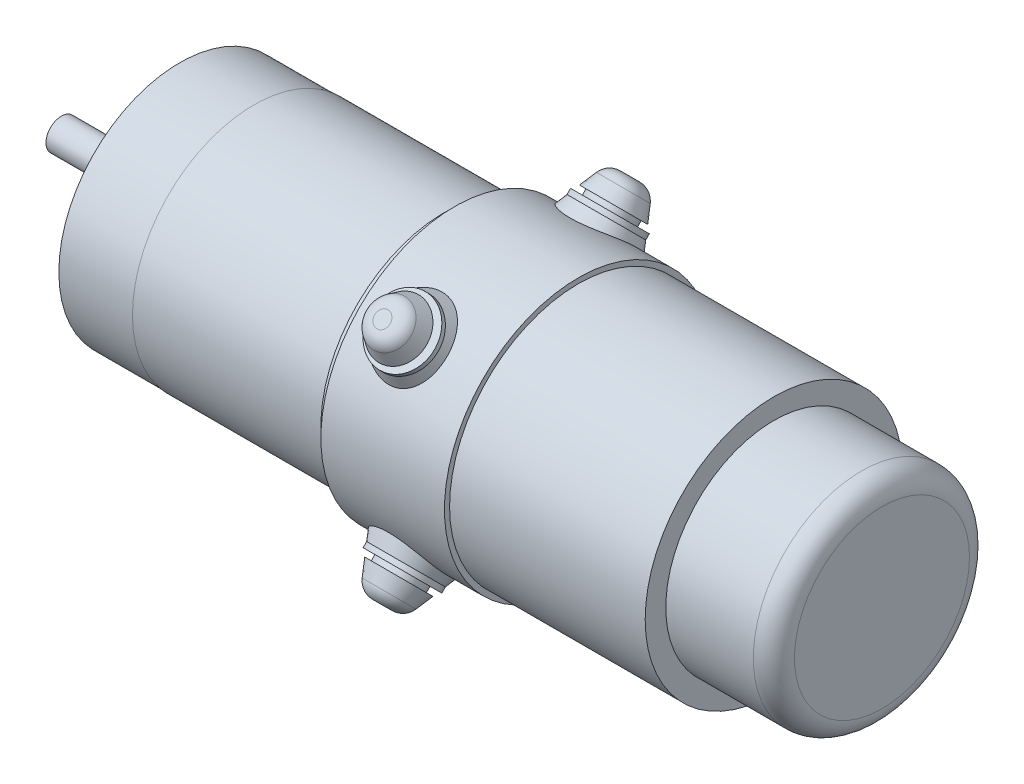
from build123d import *

# Parameters (mm, degrees)
BOSS_EXTRU_2_REACH                 = 176.404
BOSS_EXTRU_2_END_RADIUS            = 26
ESQUISSE3_R                        = 3.5
BOSS_EXTRU_2_DRAFT                 = 23
CONG_1_R                           = 3
BOSS_EXTRU_3_REACH                 = 174.245
ESQUISSE4_R                        = 6.25
ESQUISSE5_R                        = 5.834611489
ESQUISSE5_R_2                      = 4.38
ENL_V_MAT_EXTRU_1_DEPTH            = 1
R_P_TITION_CIRCULAIRE1_COUNT       = 4
CONG_1_OF_R_P_TITION_CIRCULAIRE1_R = 3
R_P_TITION_CIRCULAIRE2_COUNT       = 4


with BuildPart() as part:
    # Esquisse1 → Base-R_volution (revolve)
    with BuildSketch(Plane.XY, mode=Mode.PRIVATE) as base_r_volution_sk:
        with BuildLine():
            Line((0, 0), (0, 17))
            ThreePointArc((0, 17), (-1.171572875, 19.828427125), (-4, 21))
            Line((-4, 21), (-21, 21))
            Line((-21, 21), (-21, 25))
            Line((-21, 25), (-59, 25))
            Line((-59, 25), (-59, 26))
            Line((-59, 26), (-83, 26))
            Line((-83, 26), (-83, 24))
            Line((-83, 24), (-85, 24))
            Line((-85, 24), (-85, 23.6))
            Line((-85, 23.6), (-122, 23.6))
            Line((-122, 23.6), (-122, 23.5))
            Line((-122, 23.5), (-136.4, 23.5))
            Line((-136.4, 23.5), (-136.4, 12.5))
            Line((-136.4, 12.5), (-139.4, 12.5))
            Line((-139.4, 12.5), (-139.4, 3))
            Line((-139.4, 3), (-159.4, 3))
            Line((-159.4, 3), (-159.4, 0))
            Line((-159.4, 0), (-134.247535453, 0))
            Line((-134.247535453, 0), (-134.247535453, 21))
            Line((-134.247535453, 21), (-24.682142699, 21))
            Line((-24.682142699, 21), (-24.682142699, 17))
            Line((-24.682142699, 17), (-4.229936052, 17))
            Line((-4.229936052, 17), (-4.229936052, 0))
            Line((-4.229936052, 0), (0, 0))
        make_face()
    revolve(base_r_volution_sk.sketch.rotate(Axis((0, 0, 0), (-1, 0, 0)), 90), axis=Axis((0, 0, 0), (-1, 0, 0)))

    # Boss.-Extru.2: up to this cylinder (the profile starts outside it)
    boss_extru_2_end = Plane(origin=(-73, 0, 0), z_dir=(1, 0, 0)) * Cylinder(BOSS_EXTRU_2_END_RADIUS, 405.808, mode=Mode.PRIVATE)



with BuildPart() as boss_extru_2_long_prism_1:
    # Esquisse3 → Boss.-Extru.2 (the long prism of profile 1, to be tilted and cut off)
    with BuildSketch(Plane(origin=(0, 24.04163056, 24.04163056), x_dir=(-1, 0, 0), z_dir=(0, 0.7071067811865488, 0.7071067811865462))):
        with Locations((73, 0)):
            Circle(ESQUISSE3_R)
    extrude(amount=-BOSS_EXTRU_2_REACH)
    boss_extru_2_tool1_sides = [boss_extru_2_long_prism_1.faces().sort_by_distance(p)[0] for p in [
        (-69.5, -38.326601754, -38.326601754),
    ]]
    draft(boss_extru_2_tool1_sides, Plane(origin=(0, 24.04163056, 24.04163056), x_dir=(-1, 0, 0), z_dir=(0, 0.7071067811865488, 0.7071067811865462)), BOSS_EXTRU_2_DRAFT)  # the draft: side faces tilted about the start plane


with BuildPart() as part_1:
    add(part.part)
    boss_extru_2_tool1 = boss_extru_2_long_prism_1.part - boss_extru_2_end
    boss_extru_2 = boss_extru_2_tool1.solids().sort_by_distance((-73, 24.041631, 24.041631))[0]
    add(boss_extru_2)

    # Cong_1
    cong_1_edges = [part_1.edges().sort_by_distance(p)[0] for p in [
        (-69.5, 24.04163056, 24.04163056),
    ]]
    fillet(cong_1_edges, radius=CONG_1_R)

    # Esquisse4 → Boss.-Extru.3 (add, up to next)
    with BuildSketch(Plane(origin=(0, 20.152543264, 20.152543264), x_dir=(-1, 0, 0), z_dir=(0, 0.7071067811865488, 0.7071067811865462)), mode=Mode.PRIVATE) as boss_extru_3_sk1:
        with Locations(Location((73, 0, 0), (0, 0, 90))):
            Circle(ESQUISSE4_R)
    boss_extru_3_tool1 = extrude(boss_extru_3_sk1.sketch, amount=-BOSS_EXTRU_3_REACH, mode=Mode.PRIVATE) - part_1.part
    boss_extru_3 = boss_extru_3_tool1.solids().sort_by_distance((-73, 20.152543, 20.152543))[0]
    add(boss_extru_3)

    # Esquisse5 → Enl_v. mat.-Extru.1 (cut)
    with BuildSketch(Plane(origin=(0, 20.152543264, 20.152543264), x_dir=(-1, 0, 0), z_dir=(0, 0.7071067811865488, 0.7071067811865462))):
        with Locations((73, 0)):
            Circle(ESQUISSE5_R)
        with Locations(Location((73, 0, 0), (0, 0, 90))):
            Circle(ESQUISSE5_R_2, mode=Mode.SUBTRACT)
    enl_v_mat_extru_1 = extrude(amount=ENL_V_MAT_EXTRU_1_DEPTH, mode=Mode.SUBTRACT)

    # R_p_tition circulaire1: Boss.-Extru.2, Boss.-Extru.3, Enl_v. mat.-Extru.1 ×4 about axis
    r_p_tition_circulaire1_axis = Axis((0, 0, 0), (1, 0, 0))
    add([boss_extru_2.rotate(r_p_tition_circulaire1_axis, i * 360 / R_P_TITION_CIRCULAIRE1_COUNT) for i in range(1, R_P_TITION_CIRCULAIRE1_COUNT)])
    add([boss_extru_3.rotate(r_p_tition_circulaire1_axis, i * 360 / R_P_TITION_CIRCULAIRE1_COUNT) for i in range(1, R_P_TITION_CIRCULAIRE1_COUNT)])
    add([enl_v_mat_extru_1.rotate(r_p_tition_circulaire1_axis, i * 360 / R_P_TITION_CIRCULAIRE1_COUNT) for i in range(1, R_P_TITION_CIRCULAIRE1_COUNT)], mode=Mode.SUBTRACT)

    # Cong_1 of R_p_tition circulaire1
    cong_1_of_r_p_tition_circulaire1_edges = [part_1.edges().sort_by_distance(p)[0] for p in [
        (-69.5, -24.04163056, 24.04163056),
        (-69.5, -24.04163056, -24.04163056),
        (-69.5, 24.04163056, -24.04163056),
    ]]
    fillet(cong_1_of_r_p_tition_circulaire1_edges, radius=CONG_1_OF_R_P_TITION_CIRCULAIRE1_R)

    # Esquisse6 → Trou taraud_ M41 (revolve, cut)
    with BuildSketch(Plane(origin=(-136.4, 12.727922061, 12.727922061), x_dir=(0, 0, 1), z_dir=(0, 1, 0))):
        Polygon((0, 0), (0, 9.491420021), (1.65, 8.5), (1.65, 0), align=None)
    trou_taraud_m41 = revolve(axis=Axis((-142.75, 12.727922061, 12.727922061), (1, 0, 0)), mode=Mode.SUBTRACT)

    # R_p_tition circulaire2: Trou taraud_ M41 ×4 about axis
    r_p_tition_circulaire2_axis = Axis((0, 0, 0), (1, 0, 0))
    for i in range(1, R_P_TITION_CIRCULAIRE2_COUNT):
        add(trou_taraud_m41.rotate(r_p_tition_circulaire2_axis, i * 360 / R_P_TITION_CIRCULAIRE2_COUNT), mode=Mode.SUBTRACT)


solid = part_1.part
